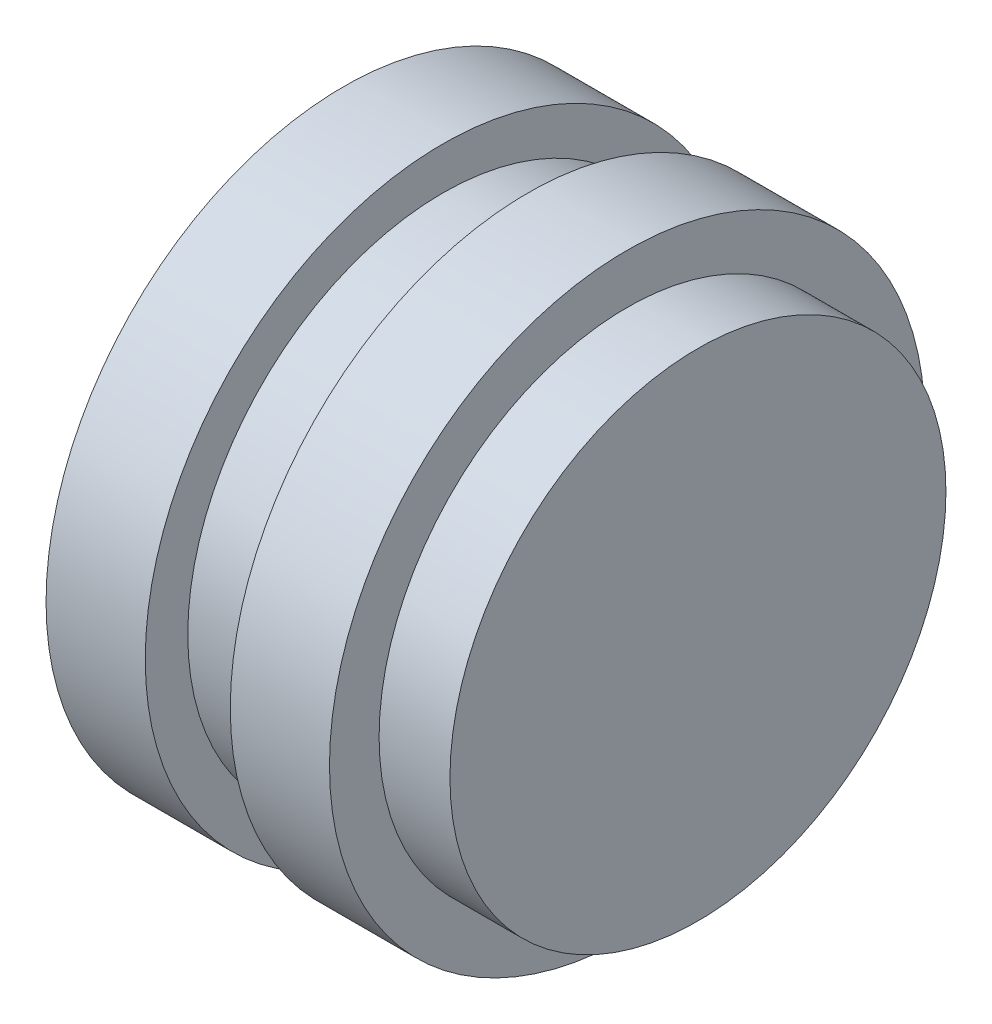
from build123d import *


with BuildPart() as part:
    # Esquisse1 → Base-R_volution (revolve)
    with BuildSketch(Plane.XY, mode=Mode.PRIVATE) as base_r_volution_sk:
        Polygon((11.5, 0), (11.5, 17.5), (6.5, 17.5), (6.5, 21), (-0.5, 21), (-0.5, 18), (-6.5, 18), (-6.5, 21), (-13.5, 21), (-13.5, 0), align=None)
    revolve(base_r_volution_sk.sketch.rotate(Axis((35.442568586, 0, 0), (-1, 0, 0)), 90), axis=Axis((35.442568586, 0, 0), (-1, 0, 0)))


solid = part.part
